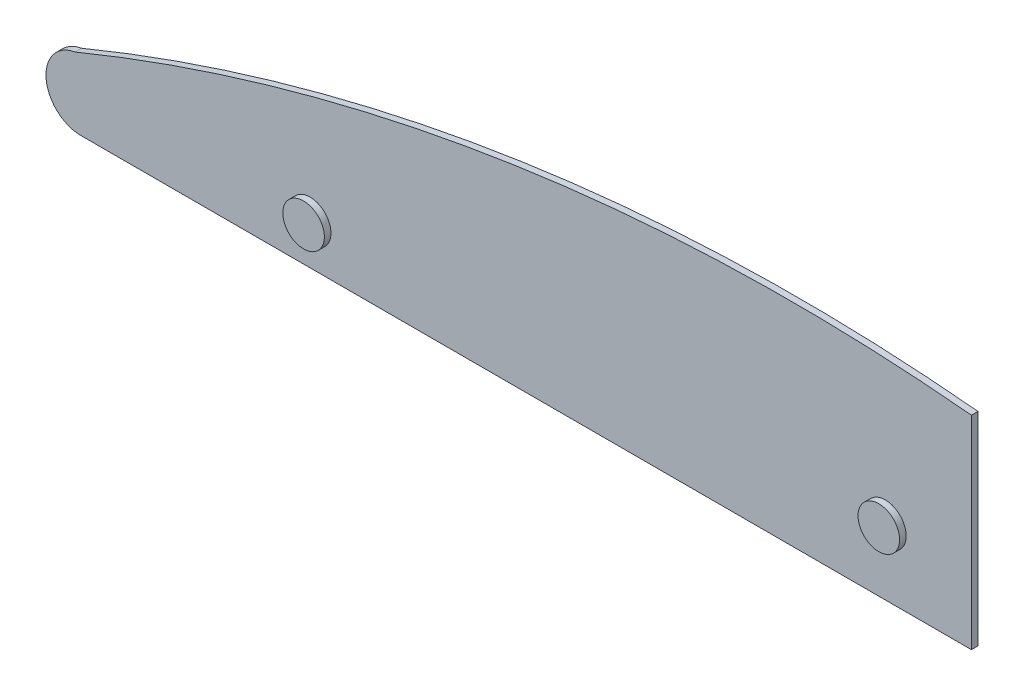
from build123d import *

# Parameters (mm, degrees)
BASE_EXTRUDE_DEPTH  = 2.667
SKETCH2_R           = 8.450958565
BOSS_EXTRUDE1_DEPTH = 2.667


with BuildPart() as part:
    # Sketch1 → Base-Extrude (new body)
    with BuildSketch(Plane.XY):
        with BuildLine():
            Line((6.35, -6.35), (6.35, 76.2))
            ThreePointArc((6.35, 76.2), (-179.146372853, 71.382862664), (-357.978470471, 21.873368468))
            ThreePointArc((-357.978470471, 21.873368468), (-369.761705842, 6.668454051), (-355.6, -6.35))
            Line((-355.6, -6.35), (6.35, -6.35))
        make_face()
    extrude(amount=BASE_EXTRUDE_DEPTH)

    # Sketch2 → Boss-Extrude1 (add)
    with BuildSketch(Plane.XY.offset(2.667)):
        with Locations((-262.437432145, 10.104106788)):
            Circle(SKETCH2_R)
        with Locations((-28.627578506, 20.433056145)):
            Circle(SKETCH2_R)
    extrude(amount=BOSS_EXTRUDE1_DEPTH)


solid = part.part
